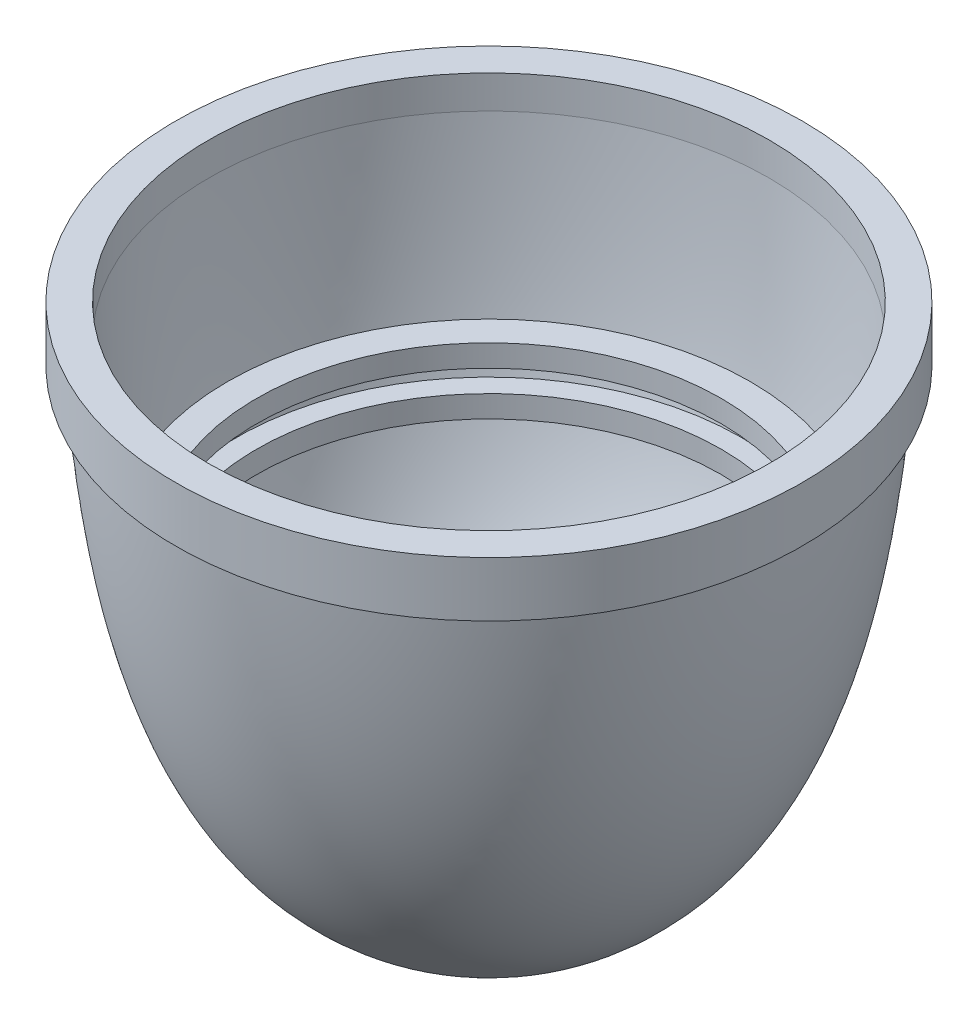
ISO-10303-21;
HEADER;
FILE_DESCRIPTION(('STEP AP214'),'2;1');
FILE_NAME('part.step','',(''),(''),'','','');
FILE_SCHEMA(('AUTOMOTIVE_DESIGN { 1 0 10303 214 1 1 1 1 }'));
ENDSEC;
DATA;
#1=APPLICATION_CONTEXT('core data for automotive mechanical design processes');
#2=APPLICATION_PROTOCOL_DEFINITION('international standard','automotive_design',2000,#1);
#3=PRODUCT_CONTEXT('',#1,'mechanical');
#4=PRODUCT('Part','Part','',(#3));
#5=PRODUCT_RELATED_PRODUCT_CATEGORY('part','',(#4));
#6=PRODUCT_DEFINITION_FORMATION('','',#4);
#7=PRODUCT_DEFINITION_CONTEXT('part definition',#1,'design');
#8=PRODUCT_DEFINITION('design','',#6,#7);
#9=PRODUCT_DEFINITION_SHAPE('','',#8);
#10=(LENGTH_UNIT() NAMED_UNIT(*) SI_UNIT(.MILLI.,.METRE.));
#11=(NAMED_UNIT(*) PLANE_ANGLE_UNIT() SI_UNIT($,.RADIAN.));
#12=(NAMED_UNIT(*) SI_UNIT($,.STERADIAN.) SOLID_ANGLE_UNIT());
#13=UNCERTAINTY_MEASURE_WITH_UNIT(LENGTH_MEASURE(1.E-05),#10,'distance_accuracy_value','');
#14=(GEOMETRIC_REPRESENTATION_CONTEXT(3) GLOBAL_UNCERTAINTY_ASSIGNED_CONTEXT((#13)) GLOBAL_UNIT_ASSIGNED_CONTEXT((#10,
#11,#12)) REPRESENTATION_CONTEXT('',''));
#15=CARTESIAN_POINT('',(0.,0.,0.));
#16=DIRECTION('',(0.,0.,1.));
#17=DIRECTION('',(1.,0.,0.));
#18=AXIS2_PLACEMENT_3D('',#15,#16,#17);
#19=CARTESIAN_POINT('',(0.,10.414,-6.94911099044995));
#20=CARTESIAN_POINT('',(0.,10.2408756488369,-6.93572821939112));
#21=CARTESIAN_POINT('',(0.,9.88578309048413,-6.90658829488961));
#22=CARTESIAN_POINT('',(0.,9.24790976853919,-6.84771185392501));
#23=CARTESIAN_POINT('',(0.,8.51832643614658,-6.76858320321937));
#24=CARTESIAN_POINT('',(0.,7.72731612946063,-6.66382672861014));
#25=CARTESIAN_POINT('',(0.,6.73551549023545,-6.5051771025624));
#26=CARTESIAN_POINT('',(0.,5.54695053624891,-6.25828392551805));
#27=CARTESIAN_POINT('',(0.,4.07241499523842,-5.81863357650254));
#28=CARTESIAN_POINT('',(0.,2.53691605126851,-5.13826946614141));
#29=CARTESIAN_POINT('',(0.,1.28754004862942,-4.25736463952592));
#30=CARTESIAN_POINT('',(0.,0.427277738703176,-3.27219684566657));
#31=CARTESIAN_POINT('',(0.,-0.0985213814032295,-2.37080966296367));
#32=CARTESIAN_POINT('',(0.,-0.388807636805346,-1.46626741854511));
#33=CARTESIAN_POINT('',(0.,-0.502083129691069,-0.656928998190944));
#34=CARTESIAN_POINT('',(0.,-0.513839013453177,-0.205804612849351));
#35=CARTESIAN_POINT('',(0.,-0.507808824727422,0.0139354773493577));
#36=B_SPLINE_CURVE_WITH_KNOTS('',3,(#19,#20,#21,#22,#23,#24,#25,#26,#27,#28,#29,#30,#31,#32,#33,
#34,#35),.UNSPECIFIED.,.F.,.F.,(4,1,1,1,1,1,1,1,1,1,1,1,1,1,4),(0.0257927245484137,
0.0562367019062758,0.0866806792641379,0.147568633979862,0.208456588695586,0.26934454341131,
0.391120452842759,0.512896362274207,0.634672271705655,0.756448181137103,0.817336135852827,
0.878224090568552,0.939112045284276,0.969556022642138,1.),.UNSPECIFIED.);
#37=CARTESIAN_POINT('',(0.,0.,0.));
#38=DIRECTION('',(0.,-1.,0.));
#39=AXIS1_PLACEMENT('',#37,#38);
#40=SURFACE_OF_REVOLUTION('',#36,#39);
#41=CARTESIAN_POINT('',(0.,-0.496286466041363,0.));
#42=DIRECTION('',(0.,-1.,0.));
#43=DIRECTION('',(0.,0.,-1.));
#44=AXIS2_PLACEMENT_3D('',#41,#42,#43);
#45=CIRCLE('',#44,0.571499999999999);
#46=CARTESIAN_POINT('',(0.,-0.496286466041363,-0.571499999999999));
#47=VERTEX_POINT('',#46);
#48=EDGE_CURVE('E81',#47,#47,#45,.F.);
#49=ORIENTED_EDGE('',*,*,#48,.T.);
#50=EDGE_LOOP('',(#49));
#51=FACE_BOUND('',#50,.T.);
#52=CARTESIAN_POINT('',(0.,10.414,0.));
#53=DIRECTION('',(0.,-1.,0.));
#54=DIRECTION('',(0.,0.,-1.));
#55=AXIS2_PLACEMENT_3D('',#52,#53,#54);
#56=CIRCLE('',#55,6.94911099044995);
#57=CARTESIAN_POINT('',(0.,10.414,-6.94911099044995));
#58=VERTEX_POINT('',#57);
#59=EDGE_CURVE('E10',#58,#58,#56,.T.);
#60=ORIENTED_EDGE('',*,*,#59,.T.);
#61=EDGE_LOOP('',(#60));
#62=FACE_BOUND('',#61,.T.);
#63=ADVANCED_FACE('F34',(#51,#62),#40,.T.);
#64=CARTESIAN_POINT('',(0.,10.414,-1.80723270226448E-12));
#65=DIRECTION('',(0.,1.,0.));
#66=DIRECTION('',(0.,0.,1.));
#67=AXIS2_PLACEMENT_3D('',#64,#65,#66);
#68=PLANE('',#67);
#69=ORIENTED_EDGE('',*,*,#59,.F.);
#70=EDGE_LOOP('',(#69));
#71=FACE_BOUND('',#70,.T.);
#72=CARTESIAN_POINT('',(0.,10.414,0.));
#73=DIRECTION('',(0.,-1.,0.));
#74=DIRECTION('',(0.,0.,-1.));
#75=AXIS2_PLACEMENT_3D('',#72,#73,#74);
#76=CIRCLE('',#75,7.239);
#77=CARTESIAN_POINT('',(0.,10.414,-7.239));
#78=VERTEX_POINT('',#77);
#79=EDGE_CURVE('E42',#78,#78,#76,.T.);
#80=ORIENTED_EDGE('',*,*,#79,.T.);
#81=EDGE_LOOP('',(#80));
#82=FACE_BOUND('',#81,.T.);
#83=ADVANCED_FACE('F135',(#71,#82),#68,.F.);
#84=CARTESIAN_POINT('',(0.,0.,0.));
#85=DIRECTION('',(0.,-1.,0.));
#86=DIRECTION('',(0.,0.,-1.));
#87=AXIS2_PLACEMENT_3D('',#84,#85,#86);
#88=CYLINDRICAL_SURFACE('',#87,7.239);
#89=ORIENTED_EDGE('',*,*,#79,.F.);
#90=EDGE_LOOP('',(#89));
#91=FACE_BOUND('',#90,.T.);
#92=CARTESIAN_POINT('',(0.,11.684,0.));
#93=DIRECTION('',(0.,-1.,0.));
#94=DIRECTION('',(0.,0.,-1.));
#95=AXIS2_PLACEMENT_3D('',#92,#93,#94);
#96=CIRCLE('',#95,7.239);
#97=CARTESIAN_POINT('',(0.,11.684,-7.239));
#98=VERTEX_POINT('',#97);
#99=EDGE_CURVE('E46',#98,#98,#96,.T.);
#100=ORIENTED_EDGE('',*,*,#99,.T.);
#101=EDGE_LOOP('',(#100));
#102=FACE_BOUND('',#101,.T.);
#103=ADVANCED_FACE('F132',(#91,#102),#88,.T.);
#104=CARTESIAN_POINT('',(0.,11.684,0.));
#105=DIRECTION('',(0.,-1.,0.));
#106=DIRECTION('',(0.,0.,-1.));
#107=AXIS2_PLACEMENT_3D('',#104,#105,#106);
#108=PLANE('',#107);
#109=ORIENTED_EDGE('',*,*,#99,.F.);
#110=EDGE_LOOP('',(#109));
#111=FACE_BOUND('',#110,.T.);
#112=CARTESIAN_POINT('',(0.,11.684,0.));
#113=DIRECTION('',(0.,-1.,0.));
#114=DIRECTION('',(0.,0.,-1.));
#115=AXIS2_PLACEMENT_3D('',#112,#113,#114);
#116=CIRCLE('',#115,6.477);
#117=CARTESIAN_POINT('',(0.,11.684,-6.477));
#118=VERTEX_POINT('',#117);
#119=EDGE_CURVE('E51',#118,#118,#116,.T.);
#120=ORIENTED_EDGE('',*,*,#119,.T.);
#121=EDGE_LOOP('',(#120));
#122=FACE_BOUND('',#121,.T.);
#123=ADVANCED_FACE('F128',(#111,#122),#108,.F.);
#124=CARTESIAN_POINT('',(0.,0.,0.));
#125=DIRECTION('',(0.,-1.,0.));
#126=DIRECTION('',(0.,0.,-1.));
#127=AXIS2_PLACEMENT_3D('',#124,#125,#126);
#128=CYLINDRICAL_SURFACE('',#127,6.477);
#129=ORIENTED_EDGE('',*,*,#119,.F.);
#130=EDGE_LOOP('',(#129));
#131=FACE_BOUND('',#130,.T.);
#132=CARTESIAN_POINT('',(0.,10.922,0.));
#133=DIRECTION('',(0.,-1.,0.));
#134=DIRECTION('',(0.,0.,-1.));
#135=AXIS2_PLACEMENT_3D('',#132,#133,#134);
#136=CIRCLE('',#135,6.477);
#137=CARTESIAN_POINT('',(0.,10.922,-6.477));
#138=VERTEX_POINT('',#137);
#139=EDGE_CURVE('E54',#138,#138,#136,.T.);
#140=ORIENTED_EDGE('',*,*,#139,.T.);
#141=EDGE_LOOP('',(#140));
#142=FACE_BOUND('',#141,.T.);
#143=ADVANCED_FACE('F125',(#131,#142),#128,.F.);
#144=CARTESIAN_POINT('',(0.,10.922,-6.477));
#145=CARTESIAN_POINT('',(0.,6.21658519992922,-6.14997408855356));
#146=CARTESIAN_POINT('',(0.,5.842,-5.66074646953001));
#147=CARTESIAN_POINT('',(0.,-0.141924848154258,-5.1717417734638));
#148=CARTESIAN_POINT('',(0.,0.,0.));
#149=B_SPLINE_CURVE_WITH_KNOTS('',4,(#144,#145,#146,#147,#148),.UNSPECIFIED.,.F.,.F.,(5,5),(0.,
1.),.UNSPECIFIED.);
#150=CARTESIAN_POINT('',(0.,0.,0.));
#151=DIRECTION('',(0.,-1.,0.));
#152=AXIS1_PLACEMENT('',#150,#151);
#153=SURFACE_OF_REVOLUTION('',#149,#152);
#154=CARTESIAN_POINT('',(0.,7.0673959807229,0.));
#155=DIRECTION('',(0.,-1.,0.));
#156=DIRECTION('',(0.,0.,-1.));
#157=AXIS2_PLACEMENT_3D('',#154,#155,#156);
#158=CIRCLE('',#157,6.03996542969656);
#159=CARTESIAN_POINT('',(0.,7.0673959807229,-6.03996542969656));
#160=VERTEX_POINT('',#159);
#161=EDGE_CURVE('E57',#160,#160,#158,.T.);
#162=ORIENTED_EDGE('',*,*,#161,.T.);
#163=EDGE_LOOP('',(#162));
#164=FACE_BOUND('',#163,.T.);
#165=ORIENTED_EDGE('',*,*,#139,.F.);
#166=EDGE_LOOP('',(#165));
#167=FACE_BOUND('',#166,.T.);
#168=ADVANCED_FACE('F100',(#164,#167),#153,.F.);
#169=CARTESIAN_POINT('',(0.,7.06739598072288,0.));
#170=DIRECTION('',(0.,-1.,0.));
#171=DIRECTION('',(0.,0.,-1.));
#172=AXIS2_PLACEMENT_3D('',#169,#170,#171);
#173=PLANE('',#172);
#174=ORIENTED_EDGE('',*,*,#161,.F.);
#175=EDGE_LOOP('',(#174));
#176=FACE_BOUND('',#175,.T.);
#177=CARTESIAN_POINT('',(0.,7.06739598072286,0.));
#178=DIRECTION('',(0.,-1.,0.));
#179=DIRECTION('',(0.,0.,-1.));
#180=AXIS2_PLACEMENT_3D('',#177,#178,#179);
#181=CIRCLE('',#180,5.36867326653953);
#182=CARTESIAN_POINT('',(0.,7.06739598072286,-5.36867326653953));
#183=VERTEX_POINT('',#182);
#184=EDGE_CURVE('E60',#183,#183,#181,.T.);
#185=ORIENTED_EDGE('',*,*,#184,.T.);
#186=EDGE_LOOP('',(#185));
#187=FACE_BOUND('',#186,.T.);
#188=ADVANCED_FACE('F120',(#176,#187),#173,.F.);
#189=CARTESIAN_POINT('',(0.,0.,0.));
#190=DIRECTION('',(0.,-1.,0.));
#191=DIRECTION('',(0.,0.,-1.));
#192=AXIS2_PLACEMENT_3D('',#189,#190,#191);
#193=CYLINDRICAL_SURFACE('',#192,5.36867326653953);
#194=ORIENTED_EDGE('',*,*,#184,.F.);
#195=EDGE_LOOP('',(#194));
#196=FACE_BOUND('',#195,.T.);
#197=CARTESIAN_POINT('',(0.,6.55939598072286,0.));
#198=DIRECTION('',(0.,-1.,0.));
#199=DIRECTION('',(0.,0.,-1.));
#200=AXIS2_PLACEMENT_3D('',#197,#198,#199);
#201=CIRCLE('',#200,5.36867326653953);
#202=CARTESIAN_POINT('',(0.,6.55939598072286,-5.36867326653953));
#203=VERTEX_POINT('',#202);
#204=EDGE_CURVE('E63',#203,#203,#201,.T.);
#205=ORIENTED_EDGE('',*,*,#204,.T.);
#206=EDGE_LOOP('',(#205));
#207=FACE_BOUND('',#206,.T.);
#208=ADVANCED_FACE('F116',(#196,#207),#193,.F.);
#209=CARTESIAN_POINT('',(0.,6.55939598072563,0.));
#210=DIRECTION('',(0.,1.,0.));
#211=DIRECTION('',(0.,0.,1.));
#212=AXIS2_PLACEMENT_3D('',#209,#210,#211);
#213=PLANE('',#212);
#214=ORIENTED_EDGE('',*,*,#204,.F.);
#215=EDGE_LOOP('',(#214));
#216=FACE_BOUND('',#215,.T.);
#217=CARTESIAN_POINT('',(0.,6.55939598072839,0.));
#218=DIRECTION('',(0.,-1.,0.));
#219=DIRECTION('',(0.,0.,-1.));
#220=AXIS2_PLACEMENT_3D('',#217,#218,#219);
#221=CIRCLE('',#220,5.94444249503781);
#222=CARTESIAN_POINT('',(0.,6.55939598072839,-5.94444249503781));
#223=VERTEX_POINT('',#222);
#224=EDGE_CURVE('E66',#223,#223,#221,.T.);
#225=ORIENTED_EDGE('',*,*,#224,.T.);
#226=EDGE_LOOP('',(#225));
#227=FACE_BOUND('',#226,.T.);
#228=ADVANCED_FACE('F113',(#216,#227),#213,.F.);
#229=CARTESIAN_POINT('',(0.,6.05139598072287,0.));
#230=DIRECTION('',(0.,-1.,0.));
#231=DIRECTION('',(0.,0.,-1.));
#232=AXIS2_PLACEMENT_3D('',#229,#230,#231);
#233=CIRCLE('',#232,5.83544876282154);
#234=CARTESIAN_POINT('',(0.,6.05139598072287,-5.83544876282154));
#235=VERTEX_POINT('',#234);
#236=EDGE_CURVE('E69',#235,#235,#233,.T.);
#237=ORIENTED_EDGE('',*,*,#236,.T.);
#238=EDGE_LOOP('',(#237));
#239=FACE_BOUND('',#238,.T.);
#240=ORIENTED_EDGE('',*,*,#224,.F.);
#241=EDGE_LOOP('',(#240));
#242=FACE_BOUND('',#241,.T.);
#243=ADVANCED_FACE('F101',(#239,#242),#153,.F.);
#244=CARTESIAN_POINT('',(0.,6.05139598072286,0.));
#245=DIRECTION('',(0.,1.,0.));
#246=DIRECTION('',(0.,0.,1.));
#247=AXIS2_PLACEMENT_3D('',#244,#245,#246);
#248=PLANE('',#247);
#249=CARTESIAN_POINT('',(0.,6.05139598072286,0.));
#250=DIRECTION('',(0.,-1.,0.));
#251=DIRECTION('',(0.,0.,-1.));
#252=AXIS2_PLACEMENT_3D('',#249,#250,#251);
#253=CIRCLE('',#252,5.36867326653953);
#254=CARTESIAN_POINT('',(0.,6.05139598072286,-5.36867326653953));
#255=VERTEX_POINT('',#254);
#256=EDGE_CURVE('E72',#255,#255,#253,.T.);
#257=ORIENTED_EDGE('',*,*,#256,.T.);
#258=EDGE_LOOP('',(#257));
#259=FACE_BOUND('',#258,.T.);
#260=ORIENTED_EDGE('',*,*,#236,.F.);
#261=EDGE_LOOP('',(#260));
#262=FACE_BOUND('',#261,.T.);
#263=ADVANCED_FACE('F108',(#259,#262),#248,.T.);
#264=CARTESIAN_POINT('',(0.,0.,0.));
#265=DIRECTION('',(0.,-1.,0.));
#266=DIRECTION('',(0.,0.,-1.));
#267=AXIS2_PLACEMENT_3D('',#264,#265,#266);
#268=CYLINDRICAL_SURFACE('',#267,5.36867326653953);
#269=CARTESIAN_POINT('',(0.,5.54339598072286,0.));
#270=DIRECTION('',(0.,-1.,0.));
#271=DIRECTION('',(0.,0.,-1.));
#272=AXIS2_PLACEMENT_3D('',#269,#270,#271);
#273=CIRCLE('',#272,5.36867326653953);
#274=CARTESIAN_POINT('',(0.,5.54339598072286,-5.36867326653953));
#275=VERTEX_POINT('',#274);
#276=EDGE_CURVE('E75',#275,#275,#273,.T.);
#277=ORIENTED_EDGE('',*,*,#276,.T.);
#278=EDGE_LOOP('',(#277));
#279=FACE_BOUND('',#278,.T.);
#280=ORIENTED_EDGE('',*,*,#256,.F.);
#281=EDGE_LOOP('',(#280));
#282=FACE_BOUND('',#281,.T.);
#283=ADVANCED_FACE('F104',(#279,#282),#268,.F.);
#284=CARTESIAN_POINT('',(0.,5.54339598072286,0.));
#285=DIRECTION('',(0.,-1.,0.));
#286=DIRECTION('',(0.,0.,-1.));
#287=AXIS2_PLACEMENT_3D('',#284,#285,#286);
#288=PLANE('',#287);
#289=CARTESIAN_POINT('',(0.,5.54339598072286,0.));
#290=DIRECTION('',(0.,-1.,0.));
#291=DIRECTION('',(0.,0.,-1.));
#292=AXIS2_PLACEMENT_3D('',#289,#290,#291);
#293=CIRCLE('',#292,5.7109490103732);
#294=CARTESIAN_POINT('',(0.,5.54339598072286,-5.7109490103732));
#295=VERTEX_POINT('',#294);
#296=EDGE_CURVE('E78',#295,#295,#293,.T.);
#297=ORIENTED_EDGE('',*,*,#296,.T.);
#298=EDGE_LOOP('',(#297));
#299=FACE_BOUND('',#298,.T.);
#300=ORIENTED_EDGE('',*,*,#276,.F.);
#301=EDGE_LOOP('',(#300));
#302=FACE_BOUND('',#301,.T.);
#303=ADVANCED_FACE('F98',(#299,#302),#288,.T.);
#304=CARTESIAN_POINT('',(0.,0.0129232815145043,0.));
#305=DIRECTION('',(0.,-1.,0.));
#306=DIRECTION('',(0.,0.,-1.));
#307=AXIS2_PLACEMENT_3D('',#304,#305,#306);
#308=CIRCLE('',#307,0.571499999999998);
#309=CARTESIAN_POINT('',(0.,0.0129232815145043,-0.571499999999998));
#310=VERTEX_POINT('',#309);
#311=EDGE_CURVE('E38',#310,#310,#308,.F.);
#312=ORIENTED_EDGE('',*,*,#311,.F.);
#313=EDGE_LOOP('',(#312));
#314=FACE_BOUND('',#313,.T.);
#315=ORIENTED_EDGE('',*,*,#296,.F.);
#316=EDGE_LOOP('',(#315));
#317=FACE_BOUND('',#316,.T.);
#318=ADVANCED_FACE('F93',(#314,#317),#153,.F.);
#319=CARTESIAN_POINT('',(0.,-2.68214638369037,0.));
#320=DIRECTION('',(0.,-1.,0.));
#321=DIRECTION('',(0.,0.,-1.));
#322=AXIS2_PLACEMENT_3D('',#319,#320,#321);
#323=CYLINDRICAL_SURFACE('',#322,0.5715);
#324=ORIENTED_EDGE('',*,*,#311,.T.);
#325=EDGE_LOOP('',(#324));
#326=FACE_BOUND('',#325,.T.);
#327=ORIENTED_EDGE('',*,*,#48,.F.);
#328=EDGE_LOOP('',(#327));
#329=FACE_BOUND('',#328,.T.);
#330=ADVANCED_FACE('F97',(#326,#329),#323,.F.);
#331=CLOSED_SHELL('',(#63,#83,#103,#123,#143,#168,#188,#208,#228,#243,#263,#283,#303,#318,#330));
#332=MANIFOLD_SOLID_BREP('B2',#331);
#333=ADVANCED_BREP_SHAPE_REPRESENTATION('',(#18,#332),#14);
#334=SHAPE_DEFINITION_REPRESENTATION(#9,#333);
ENDSEC;
END-ISO-10303-21;
